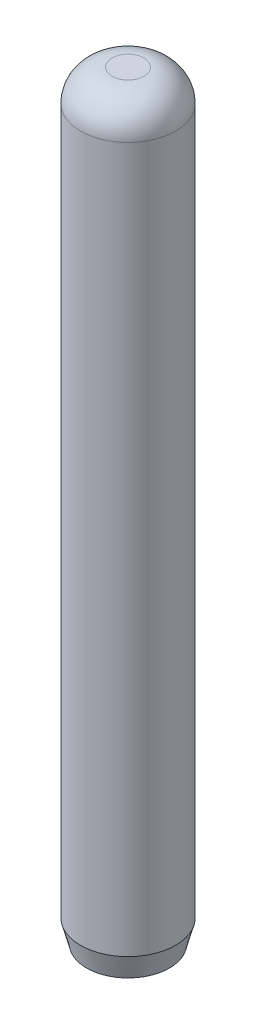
ISO-10303-21;
HEADER;
FILE_DESCRIPTION(('STEP AP214'),'2;1');
FILE_NAME('part.step','',(''),(''),'','','');
FILE_SCHEMA(('AUTOMOTIVE_DESIGN { 1 0 10303 214 1 1 1 1 }'));
ENDSEC;
DATA;
#1=APPLICATION_CONTEXT('core data for automotive mechanical design processes');
#2=APPLICATION_PROTOCOL_DEFINITION('international standard','automotive_design',2000,#1);
#3=PRODUCT_CONTEXT('',#1,'mechanical');
#4=PRODUCT('Part','Part','',(#3));
#5=PRODUCT_RELATED_PRODUCT_CATEGORY('part','',(#4));
#6=PRODUCT_DEFINITION_FORMATION('','',#4);
#7=PRODUCT_DEFINITION_CONTEXT('part definition',#1,'design');
#8=PRODUCT_DEFINITION('design','',#6,#7);
#9=PRODUCT_DEFINITION_SHAPE('','',#8);
#10=(LENGTH_UNIT() NAMED_UNIT(*) SI_UNIT(.MILLI.,.METRE.));
#11=(NAMED_UNIT(*) PLANE_ANGLE_UNIT() SI_UNIT($,.RADIAN.));
#12=(NAMED_UNIT(*) SI_UNIT($,.STERADIAN.) SOLID_ANGLE_UNIT());
#13=UNCERTAINTY_MEASURE_WITH_UNIT(LENGTH_MEASURE(1.E-05),#10,'distance_accuracy_value','');
#14=(GEOMETRIC_REPRESENTATION_CONTEXT(3) GLOBAL_UNCERTAINTY_ASSIGNED_CONTEXT((#13)) GLOBAL_UNIT_ASSIGNED_CONTEXT((#10,
#11,#12)) REPRESENTATION_CONTEXT('',''));
#15=CARTESIAN_POINT('',(0.,0.,0.));
#16=DIRECTION('',(0.,0.,1.));
#17=DIRECTION('',(1.,0.,0.));
#18=AXIS2_PLACEMENT_3D('',#15,#16,#17);
#19=CARTESIAN_POINT('',(1.1918939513,18.25625,0.));
#20=DIRECTION('',(0.,-1.,0.));
#21=DIRECTION('',(1.,0.,0.));
#22=AXIS2_PLACEMENT_3D('',#19,#20,#21);
#23=DEGENERATE_TOROIDAL_SURFACE('',#22,0.398143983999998,0.793750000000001,.T.);
#24=CARTESIAN_POINT('',(1.1918939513,19.05,0.));
#25=DIRECTION('',(0.,-1.,0.));
#26=DIRECTION('',(1.,0.,0.));
#27=AXIS2_PLACEMENT_3D('',#24,#25,#26);
#28=CIRCLE('',#27,0.398143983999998);
#29=CARTESIAN_POINT('',(1.5900379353,19.05,0.));
#30=VERTEX_POINT('',#29);
#31=EDGE_CURVE('E10',#30,#30,#28,.T.);
#32=ORIENTED_EDGE('',*,*,#31,.T.);
#33=EDGE_LOOP('',(#32));
#34=FACE_BOUND('',#33,.T.);
#35=CARTESIAN_POINT('',(1.1918939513,18.25625,0.));
#36=DIRECTION('',(0.,-1.,0.));
#37=DIRECTION('',(1.,0.,0.));
#38=AXIS2_PLACEMENT_3D('',#35,#36,#37);
#39=CIRCLE('',#38,1.191893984);
#40=CARTESIAN_POINT('',(2.3837879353,18.25625,0.));
#41=VERTEX_POINT('',#40);
#42=EDGE_CURVE('E45',#41,#41,#39,.T.);
#43=ORIENTED_EDGE('',*,*,#42,.F.);
#44=EDGE_LOOP('',(#43));
#45=FACE_BOUND('',#44,.T.);
#46=ADVANCED_FACE('F31',(#34,#45),#23,.T.);
#47=CARTESIAN_POINT('',(1.1918939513,19.05,0.));
#48=DIRECTION('',(0.,-1.,0.));
#49=DIRECTION('',(1.,0.,0.));
#50=AXIS2_PLACEMENT_3D('',#47,#48,#49);
#51=PLANE('',#50);
#52=ORIENTED_EDGE('',*,*,#31,.F.);
#53=EDGE_LOOP('',(#52));
#54=FACE_BOUND('',#53,.T.);
#55=ADVANCED_FACE('F54',(#54),#51,.F.);
#56=CARTESIAN_POINT('',(2.23049176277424,0.,0.));
#57=DIRECTION('',(0.,1.,0.));
#58=DIRECTION('',(-1.,0.,0.));
#59=AXIS2_PLACEMENT_3D('',#56,#57,#58);
#60=PLANE('',#59);
#61=CARTESIAN_POINT('',(1.1918939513,0.,0.));
#62=DIRECTION('',(0.,-1.,0.));
#63=DIRECTION('',(1.,0.,0.));
#64=AXIS2_PLACEMENT_3D('',#61,#62,#63);
#65=CIRCLE('',#64,1.03859781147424);
#66=CARTESIAN_POINT('',(2.23049176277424,0.,0.));
#67=VERTEX_POINT('',#66);
#68=EDGE_CURVE('E37',#67,#67,#65,.T.);
#69=ORIENTED_EDGE('',*,*,#68,.T.);
#70=EDGE_LOOP('',(#69));
#71=FACE_BOUND('',#70,.T.);
#72=ADVANCED_FACE('F58',(#71),#60,.F.);
#73=CARTESIAN_POINT('',(1.1918939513,0.572109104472,0.));
#74=DIRECTION('',(0.,1.,0.));
#75=DIRECTION('',(-1.,0.,0.));
#76=AXIS2_PLACEMENT_3D('',#73,#74,#75);
#77=CONICAL_SURFACE('',#76,1.191893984,0.261799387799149);
#78=ORIENTED_EDGE('',*,*,#68,.F.);
#79=EDGE_LOOP('',(#78));
#80=FACE_BOUND('',#79,.T.);
#81=CARTESIAN_POINT('',(1.1918939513,0.572109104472,0.));
#82=DIRECTION('',(0.,-1.,0.));
#83=DIRECTION('',(1.,0.,0.));
#84=AXIS2_PLACEMENT_3D('',#81,#82,#83);
#85=CIRCLE('',#84,1.191893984);
#86=CARTESIAN_POINT('',(2.3837879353,0.572109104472,0.));
#87=VERTEX_POINT('',#86);
#88=EDGE_CURVE('E41',#87,#87,#85,.T.);
#89=ORIENTED_EDGE('',*,*,#88,.T.);
#90=EDGE_LOOP('',(#89));
#91=FACE_BOUND('',#90,.T.);
#92=ADVANCED_FACE('F63',(#80,#91),#77,.T.);
#93=CARTESIAN_POINT('',(1.1918939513,0.,0.));
#94=DIRECTION('',(0.,-1.,0.));
#95=DIRECTION('',(1.,0.,0.));
#96=AXIS2_PLACEMENT_3D('',#93,#94,#95);
#97=CYLINDRICAL_SURFACE('',#96,1.191893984);
#98=ORIENTED_EDGE('',*,*,#88,.F.);
#99=EDGE_LOOP('',(#98));
#100=FACE_BOUND('',#99,.T.);
#101=ORIENTED_EDGE('',*,*,#42,.T.);
#102=EDGE_LOOP('',(#101));
#103=FACE_BOUND('',#102,.T.);
#104=ADVANCED_FACE('F51',(#100,#103),#97,.T.);
#105=CLOSED_SHELL('',(#46,#55,#72,#92,#104));
#106=MANIFOLD_SOLID_BREP('B2',#105);
#107=ADVANCED_BREP_SHAPE_REPRESENTATION('',(#18,#106),#14);
#108=SHAPE_DEFINITION_REPRESENTATION(#9,#107);
ENDSEC;
END-ISO-10303-21;
